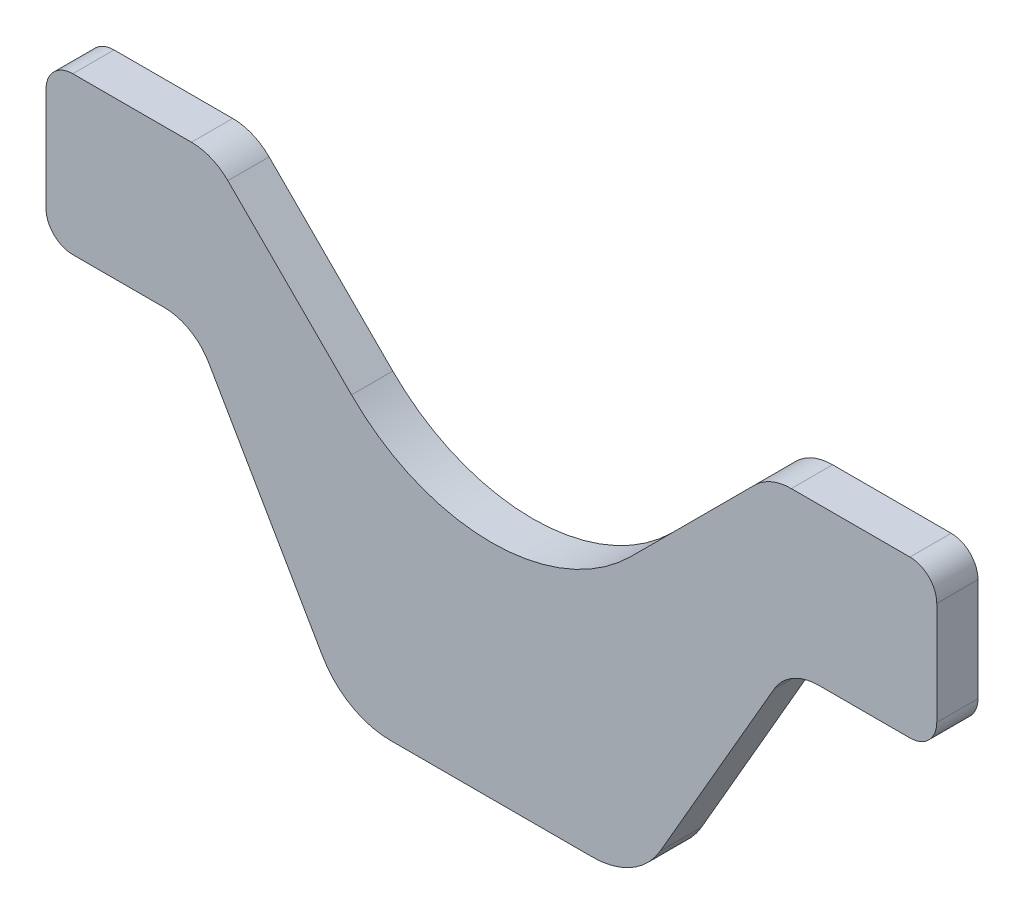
ISO-10303-21;
HEADER;
FILE_DESCRIPTION(('STEP AP214'),'2;1');
FILE_NAME('part.step','',(''),(''),'','','');
FILE_SCHEMA(('AUTOMOTIVE_DESIGN { 1 0 10303 214 1 1 1 1 }'));
ENDSEC;
DATA;
#1=APPLICATION_CONTEXT('core data for automotive mechanical design processes');
#2=APPLICATION_PROTOCOL_DEFINITION('international standard','automotive_design',2000,#1);
#3=PRODUCT_CONTEXT('',#1,'mechanical');
#4=PRODUCT('Part','Part','',(#3));
#5=PRODUCT_RELATED_PRODUCT_CATEGORY('part','',(#4));
#6=PRODUCT_DEFINITION_FORMATION('','',#4);
#7=PRODUCT_DEFINITION_CONTEXT('part definition',#1,'design');
#8=PRODUCT_DEFINITION('design','',#6,#7);
#9=PRODUCT_DEFINITION_SHAPE('','',#8);
#10=(LENGTH_UNIT() NAMED_UNIT(*) SI_UNIT(.MILLI.,.METRE.));
#11=(NAMED_UNIT(*) PLANE_ANGLE_UNIT() SI_UNIT($,.RADIAN.));
#12=(NAMED_UNIT(*) SI_UNIT($,.STERADIAN.) SOLID_ANGLE_UNIT());
#13=UNCERTAINTY_MEASURE_WITH_UNIT(LENGTH_MEASURE(1.E-05),#10,'distance_accuracy_value','');
#14=(GEOMETRIC_REPRESENTATION_CONTEXT(3) GLOBAL_UNCERTAINTY_ASSIGNED_CONTEXT((#13)) GLOBAL_UNIT_ASSIGNED_CONTEXT((#10,
#11,#12)) REPRESENTATION_CONTEXT('',''));
#15=CARTESIAN_POINT('',(0.,0.,0.));
#16=DIRECTION('',(0.,0.,1.));
#17=DIRECTION('',(1.,0.,0.));
#18=AXIS2_PLACEMENT_3D('',#15,#16,#17);
#19=CARTESIAN_POINT('',(0.,101.768340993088,10.));
#20=DIRECTION('',(0.,0.,-1.));
#21=DIRECTION('',(-1.,0.,0.));
#22=AXIS2_PLACEMENT_3D('',#19,#20,#21);
#23=CYLINDRICAL_SURFACE('',#22,47.9617169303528);
#24=CARTESIAN_POINT('',(0.,101.768340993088,0.));
#25=DIRECTION('',(0.,0.,-1.));
#26=DIRECTION('',(1.,0.,0.));
#27=AXIS2_PLACEMENT_3D('',#24,#25,#26);
#28=CIRCLE('',#27,47.9617169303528);
#29=CARTESIAN_POINT('',(33.9140552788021,67.8542857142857,0.));
#30=VERTEX_POINT('',#29);
#31=CARTESIAN_POINT('',(-33.9140552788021,67.8542857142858,0.));
#32=VERTEX_POINT('',#31);
#33=EDGE_CURVE('E213',#30,#32,#28,.T.);
#34=ORIENTED_EDGE('',*,*,#33,.T.);
#35=DIRECTION('',(0.,0.,-1.));
#36=VECTOR('',#35,1.);
#37=CARTESIAN_POINT('',(-33.9140552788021,67.8542857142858,10.));
#38=LINE('',#37,#36);
#39=CARTESIAN_POINT('',(-33.9140552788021,67.8542857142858,10.));
#40=VERTEX_POINT('',#39);
#41=EDGE_CURVE('E11',#40,#32,#38,.T.);
#42=ORIENTED_EDGE('',*,*,#41,.F.);
#43=CARTESIAN_POINT('',(0.,101.768340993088,10.));
#44=DIRECTION('',(0.,0.,-1.));
#45=DIRECTION('',(1.,0.,0.));
#46=AXIS2_PLACEMENT_3D('',#43,#44,#45);
#47=CIRCLE('',#46,47.9617169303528);
#48=CARTESIAN_POINT('',(33.9140552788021,67.8542857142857,10.));
#49=VERTEX_POINT('',#48);
#50=EDGE_CURVE('E255',#49,#40,#47,.T.);
#51=ORIENTED_EDGE('',*,*,#50,.F.);
#52=DIRECTION('',(0.,0.,-1.));
#53=VECTOR('',#52,1.);
#54=CARTESIAN_POINT('',(33.9140552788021,67.8542857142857,10.));
#55=LINE('',#54,#53);
#56=EDGE_CURVE('E209',#49,#30,#55,.T.);
#57=ORIENTED_EDGE('',*,*,#56,.T.);
#58=EDGE_LOOP('',(#34,#42,#51,#57));
#59=FACE_BOUND('',#58,.T.);
#60=ADVANCED_FACE('F33',(#59),#23,.F.);
#61=CARTESIAN_POINT('',(-63.898604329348,97.8388347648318,10.));
#62=DIRECTION('',(-0.707106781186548,-0.707106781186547,0.));
#63=DIRECTION('',(0.707106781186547,-0.707106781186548,0.));
#64=AXIS2_PLACEMENT_3D('',#61,#62,#63);
#65=PLANE('',#64);
#66=DIRECTION('',(-0.707106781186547,0.707106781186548,0.));
#67=VECTOR('',#66,1.);
#68=CARTESIAN_POINT('',(-63.898604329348,97.8388347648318,0.));
#69=LINE('',#68,#67);
#70=CARTESIAN_POINT('',(-63.898604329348,97.8388347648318,0.));
#71=VERTEX_POINT('',#70);
#72=EDGE_CURVE('E216',#32,#71,#69,.T.);
#73=ORIENTED_EDGE('',*,*,#72,.T.);
#74=DIRECTION('',(0.,0.,-1.));
#75=VECTOR('',#74,1.);
#76=CARTESIAN_POINT('',(-63.898604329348,97.8388347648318,10.));
#77=LINE('',#76,#75);
#78=CARTESIAN_POINT('',(-63.898604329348,97.8388347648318,10.));
#79=VERTEX_POINT('',#78);
#80=EDGE_CURVE('E41',#79,#71,#77,.T.);
#81=ORIENTED_EDGE('',*,*,#80,.F.);
#82=DIRECTION('',(-0.707106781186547,0.707106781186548,0.));
#83=VECTOR('',#82,1.);
#84=CARTESIAN_POINT('',(-63.898604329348,97.8388347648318,10.));
#85=LINE('',#84,#83);
#86=EDGE_CURVE('E134',#40,#79,#85,.T.);
#87=ORIENTED_EDGE('',*,*,#86,.F.);
#88=ORIENTED_EDGE('',*,*,#41,.T.);
#89=EDGE_LOOP('',(#73,#81,#87,#88));
#90=FACE_BOUND('',#89,.T.);
#91=ADVANCED_FACE('F383',(#90),#65,.F.);
#92=CARTESIAN_POINT('',(-72.7374390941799,89.,10.));
#93=DIRECTION('',(0.,0.,-1.));
#94=DIRECTION('',(-1.,0.,0.));
#95=AXIS2_PLACEMENT_3D('',#92,#93,#94);
#96=CYLINDRICAL_SURFACE('',#95,12.5);
#97=CARTESIAN_POINT('',(-72.7374390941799,89.,0.));
#98=DIRECTION('',(0.,0.,1.));
#99=DIRECTION('',(-1.,0.,0.));
#100=AXIS2_PLACEMENT_3D('',#97,#98,#99);
#101=CIRCLE('',#100,12.5);
#102=CARTESIAN_POINT('',(-72.7374390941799,101.5,0.));
#103=VERTEX_POINT('',#102);
#104=EDGE_CURVE('E218',#71,#103,#101,.T.);
#105=ORIENTED_EDGE('',*,*,#104,.T.);
#106=DIRECTION('',(0.,0.,-1.));
#107=VECTOR('',#106,1.);
#108=CARTESIAN_POINT('',(-72.7374390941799,101.5,10.));
#109=LINE('',#108,#107);
#110=CARTESIAN_POINT('',(-72.7374390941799,101.5,10.));
#111=VERTEX_POINT('',#110);
#112=EDGE_CURVE('E304',#111,#103,#109,.T.);
#113=ORIENTED_EDGE('',*,*,#112,.F.);
#114=CARTESIAN_POINT('',(-72.7374390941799,89.,10.));
#115=DIRECTION('',(0.,0.,1.));
#116=DIRECTION('',(-1.,0.,0.));
#117=AXIS2_PLACEMENT_3D('',#114,#115,#116);
#118=CIRCLE('',#117,12.5);
#119=EDGE_CURVE('E312',#79,#111,#118,.T.);
#120=ORIENTED_EDGE('',*,*,#119,.F.);
#121=ORIENTED_EDGE('',*,*,#80,.T.);
#122=EDGE_LOOP('',(#105,#113,#120,#121));
#123=FACE_BOUND('',#122,.T.);
#124=ADVANCED_FACE('F310',(#123),#96,.T.);
#125=CARTESIAN_POINT('',(-101.5,101.5,10.));
#126=DIRECTION('',(0.,-1.,0.));
#127=DIRECTION('',(0.,0.,-1.));
#128=AXIS2_PLACEMENT_3D('',#125,#126,#127);
#129=PLANE('',#128);
#130=DIRECTION('',(-1.,0.,0.));
#131=VECTOR('',#130,1.);
#132=CARTESIAN_POINT('',(-101.5,101.5,0.));
#133=LINE('',#132,#131);
#134=CARTESIAN_POINT('',(-101.5,101.5,0.));
#135=VERTEX_POINT('',#134);
#136=EDGE_CURVE('E220',#103,#135,#133,.T.);
#137=ORIENTED_EDGE('',*,*,#136,.T.);
#138=DIRECTION('',(0.,0.,-1.));
#139=VECTOR('',#138,1.);
#140=CARTESIAN_POINT('',(-101.5,101.5,10.));
#141=LINE('',#140,#139);
#142=CARTESIAN_POINT('',(-101.5,101.5,10.));
#143=VERTEX_POINT('',#142);
#144=EDGE_CURVE('E301',#143,#135,#141,.T.);
#145=ORIENTED_EDGE('',*,*,#144,.F.);
#146=DIRECTION('',(-1.,0.,0.));
#147=VECTOR('',#146,1.);
#148=CARTESIAN_POINT('',(-101.5,101.5,10.));
#149=LINE('',#148,#147);
#150=EDGE_CURVE('E330',#111,#143,#149,.T.);
#151=ORIENTED_EDGE('',*,*,#150,.F.);
#152=ORIENTED_EDGE('',*,*,#112,.T.);
#153=EDGE_LOOP('',(#137,#145,#151,#152));
#154=FACE_BOUND('',#153,.T.);
#155=ADVANCED_FACE('F321',(#154),#129,.F.);
#156=CARTESIAN_POINT('',(-101.5,95.,10.));
#157=DIRECTION('',(0.,0.,-1.));
#158=DIRECTION('',(-1.,0.,0.));
#159=AXIS2_PLACEMENT_3D('',#156,#157,#158);
#160=CYLINDRICAL_SURFACE('',#159,6.50000000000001);
#161=CARTESIAN_POINT('',(-101.5,95.,0.));
#162=DIRECTION('',(0.,0.,1.));
#163=DIRECTION('',(-1.,0.,0.));
#164=AXIS2_PLACEMENT_3D('',#161,#162,#163);
#165=CIRCLE('',#164,6.50000000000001);
#166=CARTESIAN_POINT('',(-108.,94.9999999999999,0.));
#167=VERTEX_POINT('',#166);
#168=EDGE_CURVE('E222',#135,#167,#165,.T.);
#169=ORIENTED_EDGE('',*,*,#168,.T.);
#170=DIRECTION('',(0.,0.,-1.));
#171=VECTOR('',#170,1.);
#172=CARTESIAN_POINT('',(-108.,94.9999999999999,10.));
#173=LINE('',#172,#171);
#174=CARTESIAN_POINT('',(-108.,94.9999999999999,10.));
#175=VERTEX_POINT('',#174);
#176=EDGE_CURVE('E298',#175,#167,#173,.T.);
#177=ORIENTED_EDGE('',*,*,#176,.F.);
#178=CARTESIAN_POINT('',(-101.5,95.,10.));
#179=DIRECTION('',(0.,0.,1.));
#180=DIRECTION('',(-1.,0.,0.));
#181=AXIS2_PLACEMENT_3D('',#178,#179,#180);
#182=CIRCLE('',#181,6.50000000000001);
#183=EDGE_CURVE('E327',#143,#175,#182,.T.);
#184=ORIENTED_EDGE('',*,*,#183,.F.);
#185=ORIENTED_EDGE('',*,*,#144,.T.);
#186=EDGE_LOOP('',(#169,#177,#184,#185));
#187=FACE_BOUND('',#186,.T.);
#188=ADVANCED_FACE('F325',(#187),#160,.T.);
#189=CARTESIAN_POINT('',(-108.,70.,10.));
#190=DIRECTION('',(1.,0.,0.));
#191=DIRECTION('',(0.,0.,-1.));
#192=AXIS2_PLACEMENT_3D('',#189,#190,#191);
#193=PLANE('',#192);
#194=DIRECTION('',(0.,-1.,0.));
#195=VECTOR('',#194,1.);
#196=CARTESIAN_POINT('',(-108.,70.,0.));
#197=LINE('',#196,#195);
#198=CARTESIAN_POINT('',(-108.,70.,0.));
#199=VERTEX_POINT('',#198);
#200=EDGE_CURVE('E224',#167,#199,#197,.T.);
#201=ORIENTED_EDGE('',*,*,#200,.T.);
#202=DIRECTION('',(0.,0.,-1.));
#203=VECTOR('',#202,1.);
#204=CARTESIAN_POINT('',(-108.,70.,10.));
#205=LINE('',#204,#203);
#206=CARTESIAN_POINT('',(-108.,70.,10.));
#207=VERTEX_POINT('',#206);
#208=EDGE_CURVE('E295',#207,#199,#205,.T.);
#209=ORIENTED_EDGE('',*,*,#208,.F.);
#210=DIRECTION('',(0.,-1.,0.));
#211=VECTOR('',#210,1.);
#212=CARTESIAN_POINT('',(-108.,70.,10.));
#213=LINE('',#212,#211);
#214=EDGE_CURVE('E329',#175,#207,#213,.T.);
#215=ORIENTED_EDGE('',*,*,#214,.F.);
#216=ORIENTED_EDGE('',*,*,#176,.T.);
#217=EDGE_LOOP('',(#201,#209,#215,#216));
#218=FACE_BOUND('',#217,.T.);
#219=ADVANCED_FACE('F396',(#218),#193,.F.);
#220=CARTESIAN_POINT('',(-101.5,70.,10.));
#221=DIRECTION('',(0.,0.,-1.));
#222=DIRECTION('',(-1.,0.,0.));
#223=AXIS2_PLACEMENT_3D('',#220,#221,#222);
#224=CYLINDRICAL_SURFACE('',#223,6.50000000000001);
#225=CARTESIAN_POINT('',(-101.5,70.,0.));
#226=DIRECTION('',(0.,0.,1.));
#227=DIRECTION('',(-1.,0.,0.));
#228=AXIS2_PLACEMENT_3D('',#225,#226,#227);
#229=CIRCLE('',#228,6.50000000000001);
#230=CARTESIAN_POINT('',(-101.5,63.5,0.));
#231=VERTEX_POINT('',#230);
#232=EDGE_CURVE('E226',#199,#231,#229,.T.);
#233=ORIENTED_EDGE('',*,*,#232,.T.);
#234=DIRECTION('',(0.,0.,-1.));
#235=VECTOR('',#234,1.);
#236=CARTESIAN_POINT('',(-101.5,63.5,10.));
#237=LINE('',#236,#235);
#238=CARTESIAN_POINT('',(-101.5,63.5,10.));
#239=VERTEX_POINT('',#238);
#240=EDGE_CURVE('E292',#239,#231,#237,.T.);
#241=ORIENTED_EDGE('',*,*,#240,.F.);
#242=CARTESIAN_POINT('',(-101.5,70.,10.));
#243=DIRECTION('',(0.,0.,1.));
#244=DIRECTION('',(-1.,0.,0.));
#245=AXIS2_PLACEMENT_3D('',#242,#243,#244);
#246=CIRCLE('',#245,6.50000000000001);
#247=EDGE_CURVE('E332',#207,#239,#246,.T.);
#248=ORIENTED_EDGE('',*,*,#247,.F.);
#249=ORIENTED_EDGE('',*,*,#208,.T.);
#250=EDGE_LOOP('',(#233,#241,#248,#249));
#251=FACE_BOUND('',#250,.T.);
#252=ADVANCED_FACE('F399',(#251),#224,.T.);
#253=CARTESIAN_POINT('',(-79.3482755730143,63.5,10.));
#254=DIRECTION('',(0.,1.,0.));
#255=DIRECTION('',(-1.,0.,0.));
#256=AXIS2_PLACEMENT_3D('',#253,#254,#255);
#257=PLANE('',#256);
#258=DIRECTION('',(1.,0.,0.));
#259=VECTOR('',#258,1.);
#260=CARTESIAN_POINT('',(-79.3482755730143,63.5,0.));
#261=LINE('',#260,#259);
#262=CARTESIAN_POINT('',(-79.3482755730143,63.5,0.));
#263=VERTEX_POINT('',#262);
#264=EDGE_CURVE('E228',#231,#263,#261,.T.);
#265=ORIENTED_EDGE('',*,*,#264,.T.);
#266=DIRECTION('',(0.,0.,-1.));
#267=VECTOR('',#266,1.);
#268=CARTESIAN_POINT('',(-79.3482755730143,63.5,10.));
#269=LINE('',#268,#267);
#270=CARTESIAN_POINT('',(-79.3482755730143,63.5,10.));
#271=VERTEX_POINT('',#270);
#272=EDGE_CURVE('E289',#271,#263,#269,.T.);
#273=ORIENTED_EDGE('',*,*,#272,.F.);
#274=DIRECTION('',(1.,0.,0.));
#275=VECTOR('',#274,1.);
#276=CARTESIAN_POINT('',(-79.3482755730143,63.5,10.));
#277=LINE('',#276,#275);
#278=EDGE_CURVE('E338',#239,#271,#277,.T.);
#279=ORIENTED_EDGE('',*,*,#278,.F.);
#280=ORIENTED_EDGE('',*,*,#240,.T.);
#281=EDGE_LOOP('',(#265,#273,#279,#280));
#282=FACE_BOUND('',#281,.T.);
#283=ADVANCED_FACE('F403',(#282),#257,.F.);
#284=CARTESIAN_POINT('',(-79.3482755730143,51.,10.));
#285=DIRECTION('',(0.,0.,-1.));
#286=DIRECTION('',(-1.,0.,0.));
#287=AXIS2_PLACEMENT_3D('',#284,#285,#286);
#288=CYLINDRICAL_SURFACE('',#287,12.5);
#289=CARTESIAN_POINT('',(-79.3482755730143,51.,0.));
#290=DIRECTION('',(0.,0.,-1.));
#291=DIRECTION('',(1.,0.,0.));
#292=AXIS2_PLACEMENT_3D('',#289,#290,#291);
#293=CIRCLE('',#292,12.5);
#294=CARTESIAN_POINT('',(-68.5229580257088,57.25,0.));
#295=VERTEX_POINT('',#294);
#296=EDGE_CURVE('E230',#263,#295,#293,.T.);
#297=ORIENTED_EDGE('',*,*,#296,.T.);
#298=DIRECTION('',(0.,0.,-1.));
#299=VECTOR('',#298,1.);
#300=CARTESIAN_POINT('',(-68.5229580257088,57.25,10.));
#301=LINE('',#300,#299);
#302=CARTESIAN_POINT('',(-68.5229580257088,57.25,10.));
#303=VERTEX_POINT('',#302);
#304=EDGE_CURVE('E286',#303,#295,#301,.T.);
#305=ORIENTED_EDGE('',*,*,#304,.F.);
#306=CARTESIAN_POINT('',(-79.3482755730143,51.,10.));
#307=DIRECTION('',(0.,0.,-1.));
#308=DIRECTION('',(1.,0.,0.));
#309=AXIS2_PLACEMENT_3D('',#306,#307,#308);
#310=CIRCLE('',#309,12.5);
#311=EDGE_CURVE('E340',#271,#303,#310,.T.);
#312=ORIENTED_EDGE('',*,*,#311,.F.);
#313=ORIENTED_EDGE('',*,*,#272,.T.);
#314=EDGE_LOOP('',(#297,#305,#312,#313));
#315=FACE_BOUND('',#314,.T.);
#316=ADVANCED_FACE('F407',(#315),#288,.F.);
#317=CARTESIAN_POINT('',(-40.9544826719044,9.50000000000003,10.));
#318=DIRECTION('',(0.86602540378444,0.499999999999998,0.));
#319=DIRECTION('',(-0.499999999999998,0.86602540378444,0.));
#320=AXIS2_PLACEMENT_3D('',#317,#318,#319);
#321=PLANE('',#320);
#322=DIRECTION('',(0.499999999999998,-0.86602540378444,0.));
#323=VECTOR('',#322,1.);
#324=CARTESIAN_POINT('',(-40.9544826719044,9.50000000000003,0.));
#325=LINE('',#324,#323);
#326=CARTESIAN_POINT('',(-40.9544826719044,9.50000000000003,0.));
#327=VERTEX_POINT('',#326);
#328=EDGE_CURVE('E232',#295,#327,#325,.T.);
#329=ORIENTED_EDGE('',*,*,#328,.T.);
#330=DIRECTION('',(0.,0.,-1.));
#331=VECTOR('',#330,1.);
#332=CARTESIAN_POINT('',(-40.9544826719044,9.50000000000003,10.));
#333=LINE('',#332,#331);
#334=CARTESIAN_POINT('',(-40.9544826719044,9.50000000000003,10.));
#335=VERTEX_POINT('',#334);
#336=EDGE_CURVE('E283',#335,#327,#333,.T.);
#337=ORIENTED_EDGE('',*,*,#336,.F.);
#338=DIRECTION('',(0.499999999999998,-0.86602540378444,0.));
#339=VECTOR('',#338,1.);
#340=CARTESIAN_POINT('',(-40.9544826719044,9.50000000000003,10.));
#341=LINE('',#340,#339);
#342=EDGE_CURVE('E342',#303,#335,#341,.T.);
#343=ORIENTED_EDGE('',*,*,#342,.F.);
#344=ORIENTED_EDGE('',*,*,#304,.T.);
#345=EDGE_LOOP('',(#329,#337,#343,#344));
#346=FACE_BOUND('',#345,.T.);
#347=ADVANCED_FACE('F411',(#346),#321,.F.);
#348=CARTESIAN_POINT('',(-24.5,19.,10.));
#349=DIRECTION('',(0.,0.,-1.));
#350=DIRECTION('',(-1.,0.,0.));
#351=AXIS2_PLACEMENT_3D('',#348,#349,#350);
#352=CYLINDRICAL_SURFACE('',#351,19.);
#353=CARTESIAN_POINT('',(-24.5,19.,0.));
#354=DIRECTION('',(0.,0.,1.));
#355=DIRECTION('',(-1.,0.,0.));
#356=AXIS2_PLACEMENT_3D('',#353,#354,#355);
#357=CIRCLE('',#356,19.);
#358=CARTESIAN_POINT('',(-24.5,0.,0.));
#359=VERTEX_POINT('',#358);
#360=EDGE_CURVE('E234',#327,#359,#357,.T.);
#361=ORIENTED_EDGE('',*,*,#360,.T.);
#362=DIRECTION('',(0.,0.,-1.));
#363=VECTOR('',#362,1.);
#364=CARTESIAN_POINT('',(-24.5,0.,10.));
#365=LINE('',#364,#363);
#366=CARTESIAN_POINT('',(-24.5,0.,10.));
#367=VERTEX_POINT('',#366);
#368=EDGE_CURVE('E280',#367,#359,#365,.T.);
#369=ORIENTED_EDGE('',*,*,#368,.F.);
#370=CARTESIAN_POINT('',(-24.5,19.,10.));
#371=DIRECTION('',(0.,0.,1.));
#372=DIRECTION('',(-1.,0.,0.));
#373=AXIS2_PLACEMENT_3D('',#370,#371,#372);
#374=CIRCLE('',#373,19.);
#375=EDGE_CURVE('E344',#335,#367,#374,.T.);
#376=ORIENTED_EDGE('',*,*,#375,.F.);
#377=ORIENTED_EDGE('',*,*,#336,.T.);
#378=EDGE_LOOP('',(#361,#369,#376,#377));
#379=FACE_BOUND('',#378,.T.);
#380=ADVANCED_FACE('F415',(#379),#352,.T.);
#381=CARTESIAN_POINT('',(24.5,0.,10.));
#382=DIRECTION('',(0.,1.,0.));
#383=DIRECTION('',(0.,0.,1.));
#384=AXIS2_PLACEMENT_3D('',#381,#382,#383);
#385=PLANE('',#384);
#386=DIRECTION('',(1.,0.,0.));
#387=VECTOR('',#386,1.);
#388=CARTESIAN_POINT('',(24.5,0.,0.));
#389=LINE('',#388,#387);
#390=CARTESIAN_POINT('',(24.5,0.,0.));
#391=VERTEX_POINT('',#390);
#392=EDGE_CURVE('E236',#359,#391,#389,.T.);
#393=ORIENTED_EDGE('',*,*,#392,.T.);
#394=DIRECTION('',(0.,0.,-1.));
#395=VECTOR('',#394,1.);
#396=CARTESIAN_POINT('',(24.5,0.,10.));
#397=LINE('',#396,#395);
#398=CARTESIAN_POINT('',(24.5,0.,10.));
#399=VERTEX_POINT('',#398);
#400=EDGE_CURVE('E277',#399,#391,#397,.T.);
#401=ORIENTED_EDGE('',*,*,#400,.F.);
#402=DIRECTION('',(1.,0.,0.));
#403=VECTOR('',#402,1.);
#404=CARTESIAN_POINT('',(24.5,0.,10.));
#405=LINE('',#404,#403);
#406=EDGE_CURVE('E346',#367,#399,#405,.T.);
#407=ORIENTED_EDGE('',*,*,#406,.F.);
#408=ORIENTED_EDGE('',*,*,#368,.T.);
#409=EDGE_LOOP('',(#393,#401,#407,#408));
#410=FACE_BOUND('',#409,.T.);
#411=ADVANCED_FACE('F419',(#410),#385,.F.);
#412=CARTESIAN_POINT('',(24.5,19.,10.));
#413=DIRECTION('',(0.,0.,-1.));
#414=DIRECTION('',(-1.,0.,0.));
#415=AXIS2_PLACEMENT_3D('',#412,#413,#414);
#416=CYLINDRICAL_SURFACE('',#415,19.);
#417=CARTESIAN_POINT('',(24.5,19.,0.));
#418=DIRECTION('',(0.,0.,1.));
#419=DIRECTION('',(1.,0.,0.));
#420=AXIS2_PLACEMENT_3D('',#417,#418,#419);
#421=CIRCLE('',#420,19.);
#422=CARTESIAN_POINT('',(40.9544826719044,9.50000000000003,0.));
#423=VERTEX_POINT('',#422);
#424=EDGE_CURVE('E238',#391,#423,#421,.T.);
#425=ORIENTED_EDGE('',*,*,#424,.T.);
#426=DIRECTION('',(0.,0.,-1.));
#427=VECTOR('',#426,1.);
#428=CARTESIAN_POINT('',(40.9544826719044,9.50000000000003,10.));
#429=LINE('',#428,#427);
#430=CARTESIAN_POINT('',(40.9544826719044,9.50000000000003,10.));
#431=VERTEX_POINT('',#430);
#432=EDGE_CURVE('E274',#431,#423,#429,.T.);
#433=ORIENTED_EDGE('',*,*,#432,.F.);
#434=CARTESIAN_POINT('',(24.5,19.,10.));
#435=DIRECTION('',(0.,0.,1.));
#436=DIRECTION('',(1.,0.,0.));
#437=AXIS2_PLACEMENT_3D('',#434,#435,#436);
#438=CIRCLE('',#437,19.);
#439=EDGE_CURVE('E348',#399,#431,#438,.T.);
#440=ORIENTED_EDGE('',*,*,#439,.F.);
#441=ORIENTED_EDGE('',*,*,#400,.T.);
#442=EDGE_LOOP('',(#425,#433,#440,#441));
#443=FACE_BOUND('',#442,.T.);
#444=ADVANCED_FACE('F423',(#443),#416,.T.);
#445=CARTESIAN_POINT('',(40.9544826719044,9.50000000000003,10.));
#446=DIRECTION('',(-0.86602540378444,0.499999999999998,0.));
#447=DIRECTION('',(-0.499999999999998,-0.86602540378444,0.));
#448=AXIS2_PLACEMENT_3D('',#445,#446,#447);
#449=PLANE('',#448);
#450=DIRECTION('',(0.499999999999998,0.86602540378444,0.));
#451=VECTOR('',#450,1.);
#452=CARTESIAN_POINT('',(40.9544826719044,9.50000000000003,0.));
#453=LINE('',#452,#451);
#454=CARTESIAN_POINT('',(68.5229580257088,57.25,0.));
#455=VERTEX_POINT('',#454);
#456=EDGE_CURVE('E240',#423,#455,#453,.T.);
#457=ORIENTED_EDGE('',*,*,#456,.T.);
#458=DIRECTION('',(0.,0.,-1.));
#459=VECTOR('',#458,1.);
#460=CARTESIAN_POINT('',(68.5229580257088,57.25,10.));
#461=LINE('',#460,#459);
#462=CARTESIAN_POINT('',(68.5229580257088,57.25,10.));
#463=VERTEX_POINT('',#462);
#464=EDGE_CURVE('E271',#463,#455,#461,.T.);
#465=ORIENTED_EDGE('',*,*,#464,.F.);
#466=DIRECTION('',(0.499999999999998,0.86602540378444,0.));
#467=VECTOR('',#466,1.);
#468=CARTESIAN_POINT('',(40.9544826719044,9.50000000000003,10.));
#469=LINE('',#468,#467);
#470=EDGE_CURVE('E350',#431,#463,#469,.T.);
#471=ORIENTED_EDGE('',*,*,#470,.F.);
#472=ORIENTED_EDGE('',*,*,#432,.T.);
#473=EDGE_LOOP('',(#457,#465,#471,#472));
#474=FACE_BOUND('',#473,.T.);
#475=ADVANCED_FACE('F427',(#474),#449,.F.);
#476=CARTESIAN_POINT('',(79.3482755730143,51.,10.));
#477=DIRECTION('',(0.,0.,-1.));
#478=DIRECTION('',(-1.,0.,0.));
#479=AXIS2_PLACEMENT_3D('',#476,#477,#478);
#480=CYLINDRICAL_SURFACE('',#479,12.5);
#481=CARTESIAN_POINT('',(79.3482755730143,51.,0.));
#482=DIRECTION('',(0.,0.,-1.));
#483=DIRECTION('',(-1.,0.,0.));
#484=AXIS2_PLACEMENT_3D('',#481,#482,#483);
#485=CIRCLE('',#484,12.5);
#486=CARTESIAN_POINT('',(79.3482755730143,63.5,0.));
#487=VERTEX_POINT('',#486);
#488=EDGE_CURVE('E242',#455,#487,#485,.T.);
#489=ORIENTED_EDGE('',*,*,#488,.T.);
#490=DIRECTION('',(0.,0.,-1.));
#491=VECTOR('',#490,1.);
#492=CARTESIAN_POINT('',(79.3482755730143,63.5,10.));
#493=LINE('',#492,#491);
#494=CARTESIAN_POINT('',(79.3482755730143,63.5,10.));
#495=VERTEX_POINT('',#494);
#496=EDGE_CURVE('E268',#495,#487,#493,.T.);
#497=ORIENTED_EDGE('',*,*,#496,.F.);
#498=CARTESIAN_POINT('',(79.3482755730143,51.,10.));
#499=DIRECTION('',(0.,0.,-1.));
#500=DIRECTION('',(-1.,0.,0.));
#501=AXIS2_PLACEMENT_3D('',#498,#499,#500);
#502=CIRCLE('',#501,12.5);
#503=EDGE_CURVE('E352',#463,#495,#502,.T.);
#504=ORIENTED_EDGE('',*,*,#503,.F.);
#505=ORIENTED_EDGE('',*,*,#464,.T.);
#506=EDGE_LOOP('',(#489,#497,#504,#505));
#507=FACE_BOUND('',#506,.T.);
#508=ADVANCED_FACE('F431',(#507),#480,.F.);
#509=CARTESIAN_POINT('',(79.3482755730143,63.5,10.));
#510=DIRECTION('',(0.,1.,0.));
#511=DIRECTION('',(-1.,0.,0.));
#512=AXIS2_PLACEMENT_3D('',#509,#510,#511);
#513=PLANE('',#512);
#514=DIRECTION('',(1.,0.,0.));
#515=VECTOR('',#514,1.);
#516=CARTESIAN_POINT('',(79.3482755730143,63.5,0.));
#517=LINE('',#516,#515);
#518=CARTESIAN_POINT('',(101.5,63.5,0.));
#519=VERTEX_POINT('',#518);
#520=EDGE_CURVE('E244',#487,#519,#517,.T.);
#521=ORIENTED_EDGE('',*,*,#520,.T.);
#522=DIRECTION('',(0.,0.,-1.));
#523=VECTOR('',#522,1.);
#524=CARTESIAN_POINT('',(101.5,63.5,10.));
#525=LINE('',#524,#523);
#526=CARTESIAN_POINT('',(101.5,63.5,10.));
#527=VERTEX_POINT('',#526);
#528=EDGE_CURVE('E265',#527,#519,#525,.T.);
#529=ORIENTED_EDGE('',*,*,#528,.F.);
#530=DIRECTION('',(1.,0.,0.));
#531=VECTOR('',#530,1.);
#532=CARTESIAN_POINT('',(79.3482755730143,63.5,10.));
#533=LINE('',#532,#531);
#534=EDGE_CURVE('E354',#495,#527,#533,.T.);
#535=ORIENTED_EDGE('',*,*,#534,.F.);
#536=ORIENTED_EDGE('',*,*,#496,.T.);
#537=EDGE_LOOP('',(#521,#529,#535,#536));
#538=FACE_BOUND('',#537,.T.);
#539=ADVANCED_FACE('F435',(#538),#513,.F.);
#540=CARTESIAN_POINT('',(101.5,70.,10.));
#541=DIRECTION('',(0.,0.,-1.));
#542=DIRECTION('',(-1.,0.,0.));
#543=AXIS2_PLACEMENT_3D('',#540,#541,#542);
#544=CYLINDRICAL_SURFACE('',#543,6.50000000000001);
#545=CARTESIAN_POINT('',(101.5,70.,0.));
#546=DIRECTION('',(0.,0.,1.));
#547=DIRECTION('',(1.,0.,0.));
#548=AXIS2_PLACEMENT_3D('',#545,#546,#547);
#549=CIRCLE('',#548,6.50000000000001);
#550=CARTESIAN_POINT('',(108.,70.,0.));
#551=VERTEX_POINT('',#550);
#552=EDGE_CURVE('E246',#519,#551,#549,.T.);
#553=ORIENTED_EDGE('',*,*,#552,.T.);
#554=DIRECTION('',(0.,0.,-1.));
#555=VECTOR('',#554,1.);
#556=CARTESIAN_POINT('',(108.,70.,10.));
#557=LINE('',#556,#555);
#558=CARTESIAN_POINT('',(108.,70.,10.));
#559=VERTEX_POINT('',#558);
#560=EDGE_CURVE('E262',#559,#551,#557,.T.);
#561=ORIENTED_EDGE('',*,*,#560,.F.);
#562=CARTESIAN_POINT('',(101.5,70.,10.));
#563=DIRECTION('',(0.,0.,1.));
#564=DIRECTION('',(1.,0.,0.));
#565=AXIS2_PLACEMENT_3D('',#562,#563,#564);
#566=CIRCLE('',#565,6.50000000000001);
#567=EDGE_CURVE('E356',#527,#559,#566,.T.);
#568=ORIENTED_EDGE('',*,*,#567,.F.);
#569=ORIENTED_EDGE('',*,*,#528,.T.);
#570=EDGE_LOOP('',(#553,#561,#568,#569));
#571=FACE_BOUND('',#570,.T.);
#572=ADVANCED_FACE('F439',(#571),#544,.T.);
#573=CARTESIAN_POINT('',(108.,70.,10.));
#574=DIRECTION('',(-1.,0.,0.));
#575=DIRECTION('',(0.,0.,1.));
#576=AXIS2_PLACEMENT_3D('',#573,#574,#575);
#577=PLANE('',#576);
#578=DIRECTION('',(0.,1.,0.));
#579=VECTOR('',#578,1.);
#580=CARTESIAN_POINT('',(108.,70.,0.));
#581=LINE('',#580,#579);
#582=CARTESIAN_POINT('',(108.,94.9999999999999,0.));
#583=VERTEX_POINT('',#582);
#584=EDGE_CURVE('E248',#551,#583,#581,.T.);
#585=ORIENTED_EDGE('',*,*,#584,.T.);
#586=DIRECTION('',(0.,0.,-1.));
#587=VECTOR('',#586,1.);
#588=CARTESIAN_POINT('',(108.,94.9999999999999,10.));
#589=LINE('',#588,#587);
#590=CARTESIAN_POINT('',(108.,94.9999999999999,10.));
#591=VERTEX_POINT('',#590);
#592=EDGE_CURVE('E259',#591,#583,#589,.T.);
#593=ORIENTED_EDGE('',*,*,#592,.F.);
#594=DIRECTION('',(0.,1.,0.));
#595=VECTOR('',#594,1.);
#596=CARTESIAN_POINT('',(108.,70.,10.));
#597=LINE('',#596,#595);
#598=EDGE_CURVE('E358',#559,#591,#597,.T.);
#599=ORIENTED_EDGE('',*,*,#598,.F.);
#600=ORIENTED_EDGE('',*,*,#560,.T.);
#601=EDGE_LOOP('',(#585,#593,#599,#600));
#602=FACE_BOUND('',#601,.T.);
#603=ADVANCED_FACE('F364',(#602),#577,.F.);
#604=CARTESIAN_POINT('',(101.5,95.,10.));
#605=DIRECTION('',(0.,0.,-1.));
#606=DIRECTION('',(-1.,0.,0.));
#607=AXIS2_PLACEMENT_3D('',#604,#605,#606);
#608=CYLINDRICAL_SURFACE('',#607,6.50000000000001);
#609=CARTESIAN_POINT('',(101.5,95.,0.));
#610=DIRECTION('',(0.,0.,1.));
#611=DIRECTION('',(1.,0.,0.));
#612=AXIS2_PLACEMENT_3D('',#609,#610,#611);
#613=CIRCLE('',#612,6.50000000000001);
#614=CARTESIAN_POINT('',(101.5,101.5,0.));
#615=VERTEX_POINT('',#614);
#616=EDGE_CURVE('E250',#583,#615,#613,.T.);
#617=ORIENTED_EDGE('',*,*,#616,.T.);
#618=DIRECTION('',(0.,0.,-1.));
#619=VECTOR('',#618,1.);
#620=CARTESIAN_POINT('',(101.5,101.5,10.));
#621=LINE('',#620,#619);
#622=CARTESIAN_POINT('',(101.5,101.5,10.));
#623=VERTEX_POINT('',#622);
#624=EDGE_CURVE('E204',#623,#615,#621,.T.);
#625=ORIENTED_EDGE('',*,*,#624,.F.);
#626=CARTESIAN_POINT('',(101.5,95.,10.));
#627=DIRECTION('',(0.,0.,1.));
#628=DIRECTION('',(1.,0.,0.));
#629=AXIS2_PLACEMENT_3D('',#626,#627,#628);
#630=CIRCLE('',#629,6.50000000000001);
#631=EDGE_CURVE('E195',#591,#623,#630,.T.);
#632=ORIENTED_EDGE('',*,*,#631,.F.);
#633=ORIENTED_EDGE('',*,*,#592,.T.);
#634=EDGE_LOOP('',(#617,#625,#632,#633));
#635=FACE_BOUND('',#634,.T.);
#636=ADVANCED_FACE('F368',(#635),#608,.T.);
#637=CARTESIAN_POINT('',(101.5,101.5,10.));
#638=DIRECTION('',(0.,-1.,0.));
#639=DIRECTION('',(0.,0.,-1.));
#640=AXIS2_PLACEMENT_3D('',#637,#638,#639);
#641=PLANE('',#640);
#642=DIRECTION('',(-1.,0.,0.));
#643=VECTOR('',#642,1.);
#644=CARTESIAN_POINT('',(101.5,101.5,0.));
#645=LINE('',#644,#643);
#646=CARTESIAN_POINT('',(72.7374390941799,101.5,0.));
#647=VERTEX_POINT('',#646);
#648=EDGE_CURVE('E203',#615,#647,#645,.T.);
#649=ORIENTED_EDGE('',*,*,#648,.T.);
#650=DIRECTION('',(0.,0.,-1.));
#651=VECTOR('',#650,1.);
#652=CARTESIAN_POINT('',(72.7374390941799,101.5,10.));
#653=LINE('',#652,#651);
#654=CARTESIAN_POINT('',(72.7374390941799,101.5,10.));
#655=VERTEX_POINT('',#654);
#656=EDGE_CURVE('E200',#655,#647,#653,.T.);
#657=ORIENTED_EDGE('',*,*,#656,.F.);
#658=DIRECTION('',(-1.,0.,0.));
#659=VECTOR('',#658,1.);
#660=CARTESIAN_POINT('',(101.5,101.5,10.));
#661=LINE('',#660,#659);
#662=EDGE_CURVE('E189',#623,#655,#661,.T.);
#663=ORIENTED_EDGE('',*,*,#662,.F.);
#664=ORIENTED_EDGE('',*,*,#624,.T.);
#665=EDGE_LOOP('',(#649,#657,#663,#664));
#666=FACE_BOUND('',#665,.T.);
#667=ADVANCED_FACE('F201',(#666),#641,.F.);
#668=CARTESIAN_POINT('',(72.7374390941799,89.,10.));
#669=DIRECTION('',(0.,0.,-1.));
#670=DIRECTION('',(-1.,0.,0.));
#671=AXIS2_PLACEMENT_3D('',#668,#669,#670);
#672=CYLINDRICAL_SURFACE('',#671,12.5);
#673=CARTESIAN_POINT('',(72.7374390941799,89.,0.));
#674=DIRECTION('',(0.,0.,1.));
#675=DIRECTION('',(1.,0.,0.));
#676=AXIS2_PLACEMENT_3D('',#673,#674,#675);
#677=CIRCLE('',#676,12.5);
#678=CARTESIAN_POINT('',(63.898604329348,97.8388347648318,0.));
#679=VERTEX_POINT('',#678);
#680=EDGE_CURVE('E120',#647,#679,#677,.T.);
#681=ORIENTED_EDGE('',*,*,#680,.T.);
#682=DIRECTION('',(0.,0.,-1.));
#683=VECTOR('',#682,1.);
#684=CARTESIAN_POINT('',(63.898604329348,97.8388347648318,10.));
#685=LINE('',#684,#683);
#686=CARTESIAN_POINT('',(63.898604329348,97.8388347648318,10.));
#687=VERTEX_POINT('',#686);
#688=EDGE_CURVE('E205',#687,#679,#685,.T.);
#689=ORIENTED_EDGE('',*,*,#688,.F.);
#690=CARTESIAN_POINT('',(72.7374390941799,89.,10.));
#691=DIRECTION('',(0.,0.,1.));
#692=DIRECTION('',(1.,0.,0.));
#693=AXIS2_PLACEMENT_3D('',#690,#691,#692);
#694=CIRCLE('',#693,12.5);
#695=EDGE_CURVE('E193',#655,#687,#694,.T.);
#696=ORIENTED_EDGE('',*,*,#695,.F.);
#697=ORIENTED_EDGE('',*,*,#656,.T.);
#698=EDGE_LOOP('',(#681,#689,#696,#697));
#699=FACE_BOUND('',#698,.T.);
#700=ADVANCED_FACE('F207',(#699),#672,.T.);
#701=CARTESIAN_POINT('',(63.898604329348,97.8388347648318,10.));
#702=DIRECTION('',(0.707106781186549,-0.707106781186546,0.));
#703=DIRECTION('',(0.707106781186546,0.707106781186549,0.));
#704=AXIS2_PLACEMENT_3D('',#701,#702,#703);
#705=PLANE('',#704);
#706=DIRECTION('',(-0.707106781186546,-0.707106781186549,0.));
#707=VECTOR('',#706,1.);
#708=CARTESIAN_POINT('',(63.898604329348,97.8388347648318,0.));
#709=LINE('',#708,#707);
#710=EDGE_CURVE('E126',#679,#30,#709,.T.);
#711=ORIENTED_EDGE('',*,*,#710,.T.);
#712=ORIENTED_EDGE('',*,*,#56,.F.);
#713=DIRECTION('',(-0.707106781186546,-0.707106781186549,0.));
#714=VECTOR('',#713,1.);
#715=CARTESIAN_POINT('',(63.898604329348,97.8388347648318,10.));
#716=LINE('',#715,#714);
#717=EDGE_CURVE('E49',#687,#49,#716,.T.);
#718=ORIENTED_EDGE('',*,*,#717,.F.);
#719=ORIENTED_EDGE('',*,*,#688,.T.);
#720=EDGE_LOOP('',(#711,#712,#718,#719));
#721=FACE_BOUND('',#720,.T.);
#722=ADVANCED_FACE('F372',(#721),#705,.F.);
#723=CARTESIAN_POINT('',(0.,101.768340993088,10.));
#724=DIRECTION('',(0.,0.,1.));
#725=DIRECTION('',(1.,0.,0.));
#726=AXIS2_PLACEMENT_3D('',#723,#724,#725);
#727=PLANE('',#726);
#728=ORIENTED_EDGE('',*,*,#50,.T.);
#729=ORIENTED_EDGE('',*,*,#86,.T.);
#730=ORIENTED_EDGE('',*,*,#119,.T.);
#731=ORIENTED_EDGE('',*,*,#150,.T.);
#732=ORIENTED_EDGE('',*,*,#183,.T.);
#733=ORIENTED_EDGE('',*,*,#214,.T.);
#734=ORIENTED_EDGE('',*,*,#247,.T.);
#735=ORIENTED_EDGE('',*,*,#278,.T.);
#736=ORIENTED_EDGE('',*,*,#311,.T.);
#737=ORIENTED_EDGE('',*,*,#342,.T.);
#738=ORIENTED_EDGE('',*,*,#375,.T.);
#739=ORIENTED_EDGE('',*,*,#406,.T.);
#740=ORIENTED_EDGE('',*,*,#439,.T.);
#741=ORIENTED_EDGE('',*,*,#470,.T.);
#742=ORIENTED_EDGE('',*,*,#503,.T.);
#743=ORIENTED_EDGE('',*,*,#534,.T.);
#744=ORIENTED_EDGE('',*,*,#567,.T.);
#745=ORIENTED_EDGE('',*,*,#598,.T.);
#746=ORIENTED_EDGE('',*,*,#631,.T.);
#747=ORIENTED_EDGE('',*,*,#662,.T.);
#748=ORIENTED_EDGE('',*,*,#695,.T.);
#749=ORIENTED_EDGE('',*,*,#717,.T.);
#750=EDGE_LOOP('',(#728,#729,#730,#731,#732,#733,#734,#735,#736,#737,#738,#739,#740,#741,#742,
#743,#744,#745,#746,#747,#748,#749));
#751=FACE_BOUND('',#750,.T.);
#752=ADVANCED_FACE('F191',(#751),#727,.T.);
#753=CARTESIAN_POINT('',(0.,101.768340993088,0.));
#754=DIRECTION('',(0.,0.,1.));
#755=DIRECTION('',(1.,0.,0.));
#756=AXIS2_PLACEMENT_3D('',#753,#754,#755);
#757=PLANE('',#756);
#758=ORIENTED_EDGE('',*,*,#33,.F.);
#759=ORIENTED_EDGE('',*,*,#710,.F.);
#760=ORIENTED_EDGE('',*,*,#680,.F.);
#761=ORIENTED_EDGE('',*,*,#648,.F.);
#762=ORIENTED_EDGE('',*,*,#616,.F.);
#763=ORIENTED_EDGE('',*,*,#584,.F.);
#764=ORIENTED_EDGE('',*,*,#552,.F.);
#765=ORIENTED_EDGE('',*,*,#520,.F.);
#766=ORIENTED_EDGE('',*,*,#488,.F.);
#767=ORIENTED_EDGE('',*,*,#456,.F.);
#768=ORIENTED_EDGE('',*,*,#424,.F.);
#769=ORIENTED_EDGE('',*,*,#392,.F.);
#770=ORIENTED_EDGE('',*,*,#360,.F.);
#771=ORIENTED_EDGE('',*,*,#328,.F.);
#772=ORIENTED_EDGE('',*,*,#296,.F.);
#773=ORIENTED_EDGE('',*,*,#264,.F.);
#774=ORIENTED_EDGE('',*,*,#232,.F.);
#775=ORIENTED_EDGE('',*,*,#200,.F.);
#776=ORIENTED_EDGE('',*,*,#168,.F.);
#777=ORIENTED_EDGE('',*,*,#136,.F.);
#778=ORIENTED_EDGE('',*,*,#104,.F.);
#779=ORIENTED_EDGE('',*,*,#72,.F.);
#780=EDGE_LOOP('',(#758,#759,#760,#761,#762,#763,#764,#765,#766,#767,#768,#769,#770,#771,#772,
#773,#774,#775,#776,#777,#778,#779));
#781=FACE_BOUND('',#780,.T.);
#782=ADVANCED_FACE('F316',(#781),#757,.F.);
#783=CLOSED_SHELL('',(#60,#91,#124,#155,#188,#219,#252,#283,#316,#347,#380,#411,#444,#475,#508,
#539,#572,#603,#636,#667,#700,#722,#752,#782));
#784=MANIFOLD_SOLID_BREP('B2',#783);
#785=ADVANCED_BREP_SHAPE_REPRESENTATION('',(#18,#784),#14);
#786=SHAPE_DEFINITION_REPRESENTATION(#9,#785);
ENDSEC;
END-ISO-10303-21;
